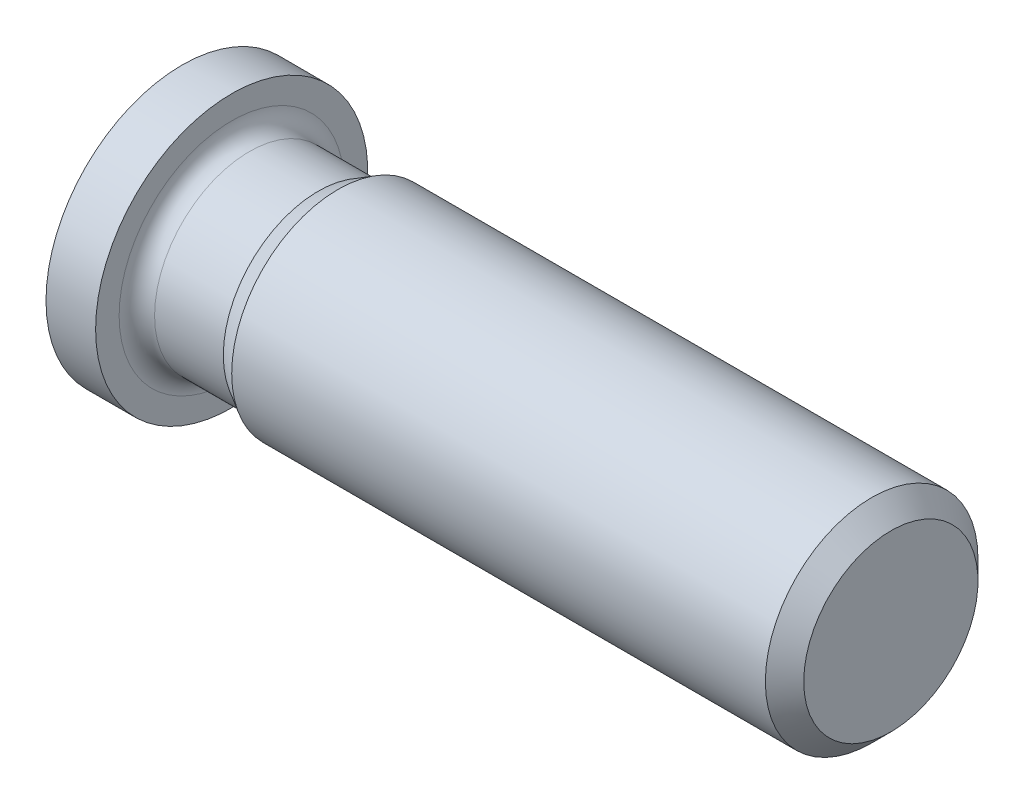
ISO-10303-21;
HEADER;
FILE_DESCRIPTION(('STEP AP214'),'2;1');
FILE_NAME('part.step','',(''),(''),'','','');
FILE_SCHEMA(('AUTOMOTIVE_DESIGN { 1 0 10303 214 1 1 1 1 }'));
ENDSEC;
DATA;
#1=APPLICATION_CONTEXT('core data for automotive mechanical design processes');
#2=APPLICATION_PROTOCOL_DEFINITION('international standard','automotive_design',2000,#1);
#3=PRODUCT_CONTEXT('',#1,'mechanical');
#4=PRODUCT('Part','Part','',(#3));
#5=PRODUCT_RELATED_PRODUCT_CATEGORY('part','',(#4));
#6=PRODUCT_DEFINITION_FORMATION('','',#4);
#7=PRODUCT_DEFINITION_CONTEXT('part definition',#1,'design');
#8=PRODUCT_DEFINITION('design','',#6,#7);
#9=PRODUCT_DEFINITION_SHAPE('','',#8);
#10=(LENGTH_UNIT() NAMED_UNIT(*) SI_UNIT(.MILLI.,.METRE.));
#11=(NAMED_UNIT(*) PLANE_ANGLE_UNIT() SI_UNIT($,.RADIAN.));
#12=(NAMED_UNIT(*) SI_UNIT($,.STERADIAN.) SOLID_ANGLE_UNIT());
#13=UNCERTAINTY_MEASURE_WITH_UNIT(LENGTH_MEASURE(1.E-05),#10,'distance_accuracy_value','');
#14=(GEOMETRIC_REPRESENTATION_CONTEXT(3) GLOBAL_UNCERTAINTY_ASSIGNED_CONTEXT((#13)) GLOBAL_UNIT_ASSIGNED_CONTEXT((#10,
#11,#12)) REPRESENTATION_CONTEXT('',''));
#15=CARTESIAN_POINT('',(0.,0.,0.));
#16=DIRECTION('',(0.,0.,1.));
#17=DIRECTION('',(1.,0.,0.));
#18=AXIS2_PLACEMENT_3D('',#15,#16,#17);
#19=CARTESIAN_POINT('',(0.,0.,0.));
#20=DIRECTION('',(1.,0.,0.));
#21=DIRECTION('',(0.,0.,-1.));
#22=AXIS2_PLACEMENT_3D('',#19,#20,#21);
#23=PLANE('',#22);
#24=CARTESIAN_POINT('',(0.,0.,0.));
#25=DIRECTION('',(-1.,0.,0.));
#26=DIRECTION('',(0.,0.,1.));
#27=AXIS2_PLACEMENT_3D('',#24,#25,#26);
#28=CIRCLE('',#27,0.44);
#29=CARTESIAN_POINT('',(0.,0.,0.44));
#30=VERTEX_POINT('',#29);
#31=EDGE_CURVE('E42',#30,#30,#28,.T.);
#32=ORIENTED_EDGE('',*,*,#31,.T.);
#33=EDGE_LOOP('',(#32));
#34=FACE_BOUND('',#33,.T.);
#35=ADVANCED_FACE('F31',(#34),#23,.F.);
#36=CARTESIAN_POINT('',(0.83,0.,0.));
#37=DIRECTION('',(1.,0.,0.));
#38=DIRECTION('',(0.,0.,-1.));
#39=AXIS2_PLACEMENT_3D('',#36,#37,#38);
#40=CONICAL_SURFACE('',#39,0.919200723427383,0.523598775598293);
#41=ORIENTED_EDGE('',*,*,#31,.F.);
#42=EDGE_LOOP('',(#41));
#43=FACE_BOUND('',#42,.T.);
#44=CARTESIAN_POINT('',(0.83,0.,0.));
#45=DIRECTION('',(-1.,0.,0.));
#46=DIRECTION('',(0.,0.,1.));
#47=AXIS2_PLACEMENT_3D('',#44,#45,#46);
#48=CIRCLE('',#47,0.919200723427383);
#49=CARTESIAN_POINT('',(0.83,0.,-0.919200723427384));
#50=VERTEX_POINT('',#49);
#51=EDGE_CURVE('E46',#50,#50,#48,.T.);
#52=ORIENTED_EDGE('',*,*,#51,.T.);
#53=EDGE_LOOP('',(#52));
#54=FACE_BOUND('',#53,.T.);
#55=ADVANCED_FACE('F85',(#43,#54),#40,.T.);
#56=CARTESIAN_POINT('',(1.13698837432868,0.,0.));
#57=DIRECTION('',(1.,0.,0.));
#58=DIRECTION('',(0.,0.,-1.));
#59=AXIS2_PLACEMENT_3D('',#56,#57,#58);
#60=CONICAL_SURFACE('',#59,3.84,1.46607657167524);
#61=CARTESIAN_POINT('',(1.13698837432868,0.,0.));
#62=DIRECTION('',(-1.,0.,0.));
#63=DIRECTION('',(0.,0.,1.));
#64=AXIS2_PLACEMENT_3D('',#61,#62,#63);
#65=CIRCLE('',#64,3.84);
#66=CARTESIAN_POINT('',(1.13698837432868,0.,-3.84));
#67=VERTEX_POINT('',#66);
#68=EDGE_CURVE('E51',#67,#67,#65,.T.);
#69=CARTESIAN_POINT('',(0.83,0.,-0.919200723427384));
#70=CARTESIAN_POINT('',(0.833197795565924,0.,-0.949625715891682));
#71=CARTESIAN_POINT('',(0.836395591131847,0.,-0.980050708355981));
#72=CARTESIAN_POINT('',(0.842791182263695,0.,-1.04090069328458));
#73=CARTESIAN_POINT('',(0.845988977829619,0.,-1.07132568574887));
#74=CARTESIAN_POINT('',(0.852384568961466,0.,-1.13217567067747));
#75=CARTESIAN_POINT('',(0.85558236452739,0.,-1.16260066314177));
#76=CARTESIAN_POINT('',(0.861977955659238,0.,-1.22345064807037));
#77=CARTESIAN_POINT('',(0.865175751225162,0.,-1.25387564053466));
#78=CARTESIAN_POINT('',(0.871571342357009,0.,-1.31472562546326));
#79=CARTESIAN_POINT('',(0.874769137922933,0.,-1.34515061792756));
#80=CARTESIAN_POINT('',(0.881164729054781,0.,-1.40600060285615));
#81=CARTESIAN_POINT('',(0.884362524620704,0.,-1.43642559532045));
#82=CARTESIAN_POINT('',(0.890758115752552,0.,-1.49727558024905));
#83=CARTESIAN_POINT('',(0.893955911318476,0.,-1.52770057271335));
#84=CARTESIAN_POINT('',(0.900351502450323,0.,-1.58855055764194));
#85=CARTESIAN_POINT('',(0.903549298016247,0.,-1.61897555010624));
#86=CARTESIAN_POINT('',(0.909944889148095,0.,-1.67982553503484));
#87=CARTESIAN_POINT('',(0.913142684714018,0.,-1.71025052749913));
#88=CARTESIAN_POINT('',(0.919538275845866,0.,-1.77110051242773));
#89=CARTESIAN_POINT('',(0.92273607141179,0.,-1.80152550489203));
#90=CARTESIAN_POINT('',(0.929131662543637,0.,-1.86237548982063));
#91=CARTESIAN_POINT('',(0.932329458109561,0.,-1.89280048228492));
#92=CARTESIAN_POINT('',(0.938725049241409,0.,-1.95365046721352));
#93=CARTESIAN_POINT('',(0.941922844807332,0.,-1.98407545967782));
#94=CARTESIAN_POINT('',(0.94831843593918,0.,-2.04492544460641));
#95=CARTESIAN_POINT('',(0.951516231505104,0.,-2.07535043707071));
#96=CARTESIAN_POINT('',(0.957911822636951,0.,-2.13620042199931));
#97=CARTESIAN_POINT('',(0.961109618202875,0.,-2.16662541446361));
#98=CARTESIAN_POINT('',(0.967505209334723,0.,-2.2274753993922));
#99=CARTESIAN_POINT('',(0.970703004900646,0.,-2.2579003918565));
#100=CARTESIAN_POINT('',(0.977098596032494,0.,-2.3187503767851));
#101=CARTESIAN_POINT('',(0.980296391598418,0.,-2.34917536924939));
#102=CARTESIAN_POINT('',(0.986691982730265,0.,-2.41002535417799));
#103=CARTESIAN_POINT('',(0.989889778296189,0.,-2.44045034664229));
#104=CARTESIAN_POINT('',(0.996285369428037,0.,-2.50130033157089));
#105=CARTESIAN_POINT('',(0.999483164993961,0.,-2.53172532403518));
#106=CARTESIAN_POINT('',(1.00587875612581,0.,-2.59257530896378));
#107=CARTESIAN_POINT('',(1.00907655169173,0.,-2.62300030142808));
#108=CARTESIAN_POINT('',(1.01547214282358,0.,-2.68385028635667));
#109=CARTESIAN_POINT('',(1.0186699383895,0.,-2.71427527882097));
#110=CARTESIAN_POINT('',(1.02506552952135,0.,-2.77512526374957));
#111=CARTESIAN_POINT('',(1.02826332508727,0.,-2.80555025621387));
#112=CARTESIAN_POINT('',(1.03465891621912,0.,-2.86640024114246));
#113=CARTESIAN_POINT('',(1.03785671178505,0.,-2.89682523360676));
#114=CARTESIAN_POINT('',(1.04425230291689,0.,-2.95767521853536));
#115=CARTESIAN_POINT('',(1.04745009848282,0.,-2.98810021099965));
#116=CARTESIAN_POINT('',(1.05384568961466,0.,-3.04895019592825));
#117=CARTESIAN_POINT('',(1.05704348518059,0.,-3.07937518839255));
#118=CARTESIAN_POINT('',(1.06343907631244,0.,-3.14022517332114));
#119=CARTESIAN_POINT('',(1.06663687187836,0.,-3.17065016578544));
#120=CARTESIAN_POINT('',(1.07303246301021,0.,-3.23150015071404));
#121=CARTESIAN_POINT('',(1.07623025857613,0.,-3.26192514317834));
#122=CARTESIAN_POINT('',(1.08262584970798,0.,-3.32277512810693));
#123=CARTESIAN_POINT('',(1.0858236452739,0.,-3.35320012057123));
#124=CARTESIAN_POINT('',(1.09221923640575,0.,-3.41405010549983));
#125=CARTESIAN_POINT('',(1.09541703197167,0.,-3.44447509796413));
#126=CARTESIAN_POINT('',(1.10181262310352,0.,-3.50532508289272));
#127=CARTESIAN_POINT('',(1.10501041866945,0.,-3.53575007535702));
#128=CARTESIAN_POINT('',(1.11140600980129,0.,-3.59660006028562));
#129=CARTESIAN_POINT('',(1.11460380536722,0.,-3.62702505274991));
#130=CARTESIAN_POINT('',(1.12099939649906,0.,-3.68787503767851));
#131=CARTESIAN_POINT('',(1.12419719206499,0.,-3.71830003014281));
#132=CARTESIAN_POINT('',(1.13059278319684,0.,-3.7791500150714));
#133=CARTESIAN_POINT('',(1.13379057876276,0.,-3.8095750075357));
#134=CARTESIAN_POINT('',(1.13698837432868,0.,-3.84));
#135=B_SPLINE_CURVE_WITH_KNOTS('',3,(#69,#70,#71,#72,#73,#74,#75,#76,#77,#78,#79,#80,#81,#82,
#83,#84,#85,#86,#87,#88,#89,#90,#91,#92,#93,#94,#95,#96,#97,#98,#99,#100,#101,#102,#103,#104,
#105,#106,#107,#108,#109,#110,#111,#112,#113,#114,#115,#116,#117,#118,#119,#120,#121,#122,#123,
#124,#125,#126,#127,#128,#129,#130,#131,#132,#133,#134),.UNSPECIFIED.,.F.,.F.,(4,2,2,2,2,2,2,2,
2,2,2,2,2,2,2,2,2,2,2,2,2,2,2,2,2,2,2,2,2,2,2,2,4),(0.,0.0917777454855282,0.183555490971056,
0.275333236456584,0.367110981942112,0.458888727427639,0.550666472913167,0.642444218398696,
0.734221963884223,0.825999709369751,0.91777745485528,1.00955520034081,1.10133294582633,
1.19311069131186,1.28488843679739,1.37666618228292,1.46844392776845,1.56022167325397,
1.6519994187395,1.74377716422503,1.83555490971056,1.92733265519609,2.01911040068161,
2.11088814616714,2.20266589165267,2.2944436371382,2.38622138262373,2.47799912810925,
2.56977687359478,2.66155461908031,2.75333236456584,2.84511011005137,2.93688785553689),.UNSPECIFIED.);
#136=EDGE_CURVE('BSEAM90',#50,#67,#135,.T.);
#137=ORIENTED_EDGE('',*,*,#51,.F.);
#138=ORIENTED_EDGE('',*,*,#68,.T.);
#139=ORIENTED_EDGE('',*,*,#136,.T.);
#140=ORIENTED_EDGE('',*,*,#136,.F.);
#141=EDGE_LOOP('',(#137,#139,#138,#140));
#142=FACE_BOUND('',#141,.T.);
#143=ADVANCED_FACE('F90',(#142),#60,.T.);
#144=CARTESIAN_POINT('',(0.,0.,0.));
#145=DIRECTION('',(-1.,0.,0.));
#146=DIRECTION('',(0.,0.,1.));
#147=AXIS2_PLACEMENT_3D('',#144,#145,#146);
#148=CYLINDRICAL_SURFACE('',#147,3.84);
#149=ORIENTED_EDGE('',*,*,#68,.F.);
#150=EDGE_LOOP('',(#149));
#151=FACE_BOUND('',#150,.T.);
#152=CARTESIAN_POINT('',(2.53698837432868,0.,0.));
#153=DIRECTION('',(-1.,0.,0.));
#154=DIRECTION('',(0.,0.,1.));
#155=AXIS2_PLACEMENT_3D('',#152,#153,#154);
#156=CIRCLE('',#155,3.84);
#157=CARTESIAN_POINT('',(2.53698837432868,0.,3.84));
#158=VERTEX_POINT('',#157);
#159=EDGE_CURVE('E54',#158,#158,#156,.T.);
#160=ORIENTED_EDGE('',*,*,#159,.T.);
#161=EDGE_LOOP('',(#160));
#162=FACE_BOUND('',#161,.T.);
#163=ADVANCED_FACE('F96',(#151,#162),#148,.T.);
#164=CARTESIAN_POINT('',(2.53698837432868,3.84,0.));
#165=DIRECTION('',(-1.,0.,0.));
#166=DIRECTION('',(0.,0.,1.));
#167=AXIS2_PLACEMENT_3D('',#164,#165,#166);
#168=PLANE('',#167);
#169=ORIENTED_EDGE('',*,*,#159,.F.);
#170=EDGE_LOOP('',(#169));
#171=FACE_BOUND('',#170,.T.);
#172=CARTESIAN_POINT('',(2.53698837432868,0.,0.));
#173=DIRECTION('',(-1.,0.,0.));
#174=DIRECTION('',(0.,0.,1.));
#175=AXIS2_PLACEMENT_3D('',#172,#173,#174);
#176=CIRCLE('',#175,3.1765);
#177=CARTESIAN_POINT('',(2.53698837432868,0.,3.1765));
#178=VERTEX_POINT('',#177);
#179=EDGE_CURVE('E57',#178,#178,#176,.T.);
#180=ORIENTED_EDGE('',*,*,#179,.T.);
#181=EDGE_LOOP('',(#180));
#182=FACE_BOUND('',#181,.T.);
#183=ADVANCED_FACE('F100',(#171,#182),#168,.F.);
#184=CARTESIAN_POINT('',(3.03698837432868,0.,0.));
#185=DIRECTION('',(-1.,0.,0.));
#186=DIRECTION('',(0.,0.,1.));
#187=AXIS2_PLACEMENT_3D('',#184,#185,#186);
#188=TOROIDAL_SURFACE('',#187,3.1765,0.5);
#189=ORIENTED_EDGE('',*,*,#179,.F.);
#190=EDGE_LOOP('',(#189));
#191=FACE_BOUND('',#190,.T.);
#192=CARTESIAN_POINT('',(3.03698837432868,0.,0.));
#193=DIRECTION('',(-1.,0.,0.));
#194=DIRECTION('',(0.,0.,1.));
#195=AXIS2_PLACEMENT_3D('',#192,#193,#194);
#196=CIRCLE('',#195,2.6765);
#197=CARTESIAN_POINT('',(3.03698837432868,0.,2.6765));
#198=VERTEX_POINT('',#197);
#199=EDGE_CURVE('E60',#198,#198,#196,.T.);
#200=ORIENTED_EDGE('',*,*,#199,.T.);
#201=EDGE_LOOP('',(#200));
#202=FACE_BOUND('',#201,.T.);
#203=ADVANCED_FACE('F104',(#191,#202),#188,.F.);
#204=CARTESIAN_POINT('',(0.,0.,0.));
#205=DIRECTION('',(-1.,0.,0.));
#206=DIRECTION('',(0.,0.,1.));
#207=AXIS2_PLACEMENT_3D('',#204,#205,#206);
#208=CYLINDRICAL_SURFACE('',#207,2.6765);
#209=ORIENTED_EDGE('',*,*,#199,.F.);
#210=EDGE_LOOP('',(#209));
#211=FACE_BOUND('',#210,.T.);
#212=CARTESIAN_POINT('',(4.97666993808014,0.,0.));
#213=DIRECTION('',(-1.,0.,0.));
#214=DIRECTION('',(0.,0.,1.));
#215=AXIS2_PLACEMENT_3D('',#212,#213,#214);
#216=CIRCLE('',#215,2.6765);
#217=CARTESIAN_POINT('',(4.97666993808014,0.,2.6765));
#218=VERTEX_POINT('',#217);
#219=EDGE_CURVE('E63',#218,#218,#216,.T.);
#220=ORIENTED_EDGE('',*,*,#219,.T.);
#221=EDGE_LOOP('',(#220));
#222=FACE_BOUND('',#221,.T.);
#223=ADVANCED_FACE('F81',(#211,#222),#208,.T.);
#224=CARTESIAN_POINT('',(5.53698837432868,0.,0.));
#225=DIRECTION('',(1.,0.,0.));
#226=DIRECTION('',(0.,0.,-1.));
#227=AXIS2_PLACEMENT_3D('',#224,#225,#226);
#228=CONICAL_SURFACE('',#227,3.,0.523598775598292);
#229=ORIENTED_EDGE('',*,*,#219,.F.);
#230=EDGE_LOOP('',(#229));
#231=FACE_BOUND('',#230,.T.);
#232=CARTESIAN_POINT('',(5.53698837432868,0.,0.));
#233=DIRECTION('',(-1.,0.,0.));
#234=DIRECTION('',(0.,0.,1.));
#235=AXIS2_PLACEMENT_3D('',#232,#233,#234);
#236=CIRCLE('',#235,3.);
#237=CARTESIAN_POINT('',(5.53698837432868,0.,3.));
#238=VERTEX_POINT('',#237);
#239=EDGE_CURVE('E66',#238,#238,#236,.T.);
#240=ORIENTED_EDGE('',*,*,#239,.T.);
#241=EDGE_LOOP('',(#240));
#242=FACE_BOUND('',#241,.T.);
#243=ADVANCED_FACE('F70',(#231,#242),#228,.T.);
#244=CARTESIAN_POINT('',(0.,0.,0.));
#245=DIRECTION('',(-1.,0.,0.));
#246=DIRECTION('',(0.,0.,1.));
#247=AXIS2_PLACEMENT_3D('',#244,#245,#246);
#248=CYLINDRICAL_SURFACE('',#247,3.);
#249=CARTESIAN_POINT('',(20.5954883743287,0.,0.));
#250=DIRECTION('',(-1.,0.,0.));
#251=DIRECTION('',(0.,0.,1.));
#252=AXIS2_PLACEMENT_3D('',#249,#250,#251);
#253=CIRCLE('',#252,3.);
#254=CARTESIAN_POINT('',(20.5954883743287,0.,3.));
#255=VERTEX_POINT('',#254);
#256=EDGE_CURVE('E38',#255,#255,#253,.T.);
#257=ORIENTED_EDGE('',*,*,#256,.T.);
#258=EDGE_LOOP('',(#257));
#259=FACE_BOUND('',#258,.T.);
#260=ORIENTED_EDGE('',*,*,#239,.F.);
#261=EDGE_LOOP('',(#260));
#262=FACE_BOUND('',#261,.T.);
#263=ADVANCED_FACE('F72',(#259,#262),#248,.T.);
#264=CARTESIAN_POINT('',(21.1369883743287,3.,0.));
#265=DIRECTION('',(-1.,0.,0.));
#266=DIRECTION('',(0.,0.,1.));
#267=AXIS2_PLACEMENT_3D('',#264,#265,#266);
#268=PLANE('',#267);
#269=CARTESIAN_POINT('',(21.1369883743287,0.,0.));
#270=DIRECTION('',(-1.,0.,0.));
#271=DIRECTION('',(0.,0.,1.));
#272=AXIS2_PLACEMENT_3D('',#269,#270,#271);
#273=CIRCLE('',#272,2.4585);
#274=CARTESIAN_POINT('',(21.1369883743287,0.,2.4585));
#275=VERTEX_POINT('',#274);
#276=EDGE_CURVE('E10',#275,#275,#273,.F.);
#277=ORIENTED_EDGE('',*,*,#276,.T.);
#278=EDGE_LOOP('',(#277));
#279=FACE_BOUND('',#278,.T.);
#280=ADVANCED_FACE('F74',(#279),#268,.F.);
#281=CARTESIAN_POINT('',(20.5954883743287,0.,0.));
#282=DIRECTION('',(-1.,0.,0.));
#283=DIRECTION('',(0.,0.,1.));
#284=AXIS2_PLACEMENT_3D('',#281,#282,#283);
#285=CONICAL_SURFACE('',#284,3.,0.785398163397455);
#286=ORIENTED_EDGE('',*,*,#276,.F.);
#287=EDGE_LOOP('',(#286));
#288=FACE_BOUND('',#287,.T.);
#289=ORIENTED_EDGE('',*,*,#256,.F.);
#290=EDGE_LOOP('',(#289));
#291=FACE_BOUND('',#290,.T.);
#292=ADVANCED_FACE('F33',(#288,#291),#285,.T.);
#293=CLOSED_SHELL('',(#35,#55,#143,#163,#183,#203,#223,#243,#263,#280,#292));
#294=MANIFOLD_SOLID_BREP('B2',#293);
#295=ADVANCED_BREP_SHAPE_REPRESENTATION('',(#18,#294),#14);
#296=SHAPE_DEFINITION_REPRESENTATION(#9,#295);
ENDSEC;
END-ISO-10303-21;
